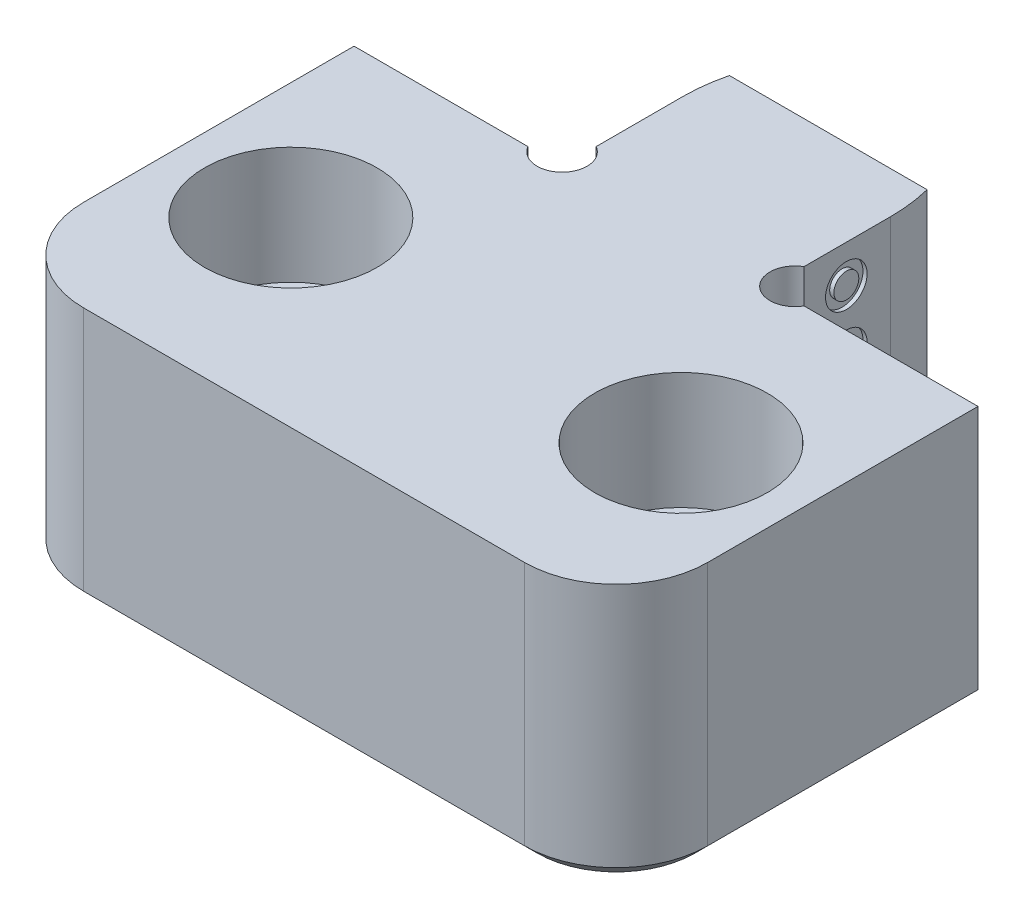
from build123d import *

# Parameters (mm, degrees)
BOSS_EXTRUDE1_DEPTH     = 15.748
SKETCH3_R               = 1.524
CUT_EXTRUDE2_DEPTH      = 34.154541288
CUT_EXTRUDE3_DEPTH      = 47.775325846
FILLET1_R               = 5.588
CHAMFER3_SIZE           = 0.762
F_1_4_CBORE_D           = 7.1374
F_1_4_CBORE_CBORE_D     = 10.541
F_1_4_CBORE_CBORE_DEPTH = 7.14502
SKETCH8_R               = 1.27
SKETCH8_R_2             = 0.762
CUT_EXTRUDE4_DEPTH      = 0.254


with BuildPart() as part:
    # Sketch1 → Boss-Extrude1 (new body)
    with BuildSketch(Plane(origin=(0, 0, 0), x_dir=(1, 0, 0), z_dir=(0, 1, 0))):
        with BuildLine():
            Line((-19.05, -22.098), (19.05, -22.098))
            Line((19.05, -22.098), (19.05, 0))
            Line((19.05, 0), (6.34746, 0))
            Line((6.34746, 0), (6.34746, 7.366))
            ThreePointArc((6.34746, 7.366), (6.269189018, 8.645540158), (6.035543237, 9.906))
            Line((6.035543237, 9.906), (-6.035543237, 9.906))
            ThreePointArc((-6.035543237, 9.906), (-6.269189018, 8.645540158), (-6.34746, 7.366))
            Line((-6.34746, 7.366), (-6.34746, 0))
            Line((-6.34746, 0), (-19.05, 0))
            Line((-19.05, 0), (-19.05, -22.098))
        make_face()
    extrude(amount=-BOSS_EXTRUDE1_DEPTH)

    # Sketch3 → Cut-Extrude2 (cut, through all)
    with BuildSketch(Plane(origin=(0, 0, 0), x_dir=(1, 0, 0), z_dir=(0, 1, 0))):
        with Locations((7.10946, 0.762)):
            Circle(SKETCH3_R)
        with Locations((-7.10946, 0.762)):
            Circle(SKETCH3_R)
    extrude(amount=-CUT_EXTRUDE2_DEPTH, mode=Mode.SUBTRACT)

    # Sketch5 → Cut-Extrude3 (cut, through all)
    with BuildSketch(Plane(origin=(19.05, 0, 0), x_dir=(0, 0, -1), z_dir=(1, 0, 0))):
        with BuildLine():
            Line((0, -15.494), (0, -31.065231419))
            Line((0, -31.065231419), (50.8, -31.065231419))
            Line((50.8, -31.065231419), (50.8, 7.034768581))
            ThreePointArc((50.8, 7.034768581), (29.03087619, -9.587069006), (2.286, -15.494))
            Line((2.286, -15.494), (0, -15.494))
        make_face()
    extrude(amount=-CUT_EXTRUDE3_DEPTH, mode=Mode.SUBTRACT)

    # Fillet1
    fillet1_edges = [part.edges().sort_by_distance(p)[0] for p in [
        (19.05, -7.874, 22.098),
        (-19.05, -7.874, 22.098),
    ]]
    fillet(fillet1_edges, radius=FILLET1_R)

    # Chamfer3
    chamfer3_edges = [part.edges().sort_by_distance(p)[0] for p in [
        (-19.05, -15.748, 8.255),
        (0, -15.748, 22.098),
        (19.05, -15.748, 8.255),
        (17.413312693, -15.748, 20.461312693),
        (-17.413312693, -15.748, 20.461312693),
    ]]
    chamfer(chamfer3_edges, length=CHAMFER3_SIZE)

    # 1_4_ CBORE (through all)
    with Locations(Plane(origin=(0, 0, 0), x_dir=(-1, 0, 0), z_dir=(0, 1, 0))):
        with Locations((11.9126, 10.9982), (-11.9126, 10.9982)):
            CounterBoreHole(F_1_4_CBORE_D / 2, F_1_4_CBORE_CBORE_D / 2, F_1_4_CBORE_CBORE_DEPTH)

    # Sketch8 → Cut-Extrude4 (cut)
    # profile 1 of 4: a face of its own
    with BuildSketch(Plane(origin=(6.34746, 0, 0), x_dir=(0, 0, -1), z_dir=(1, 0, 0))):
        with Locations((4.662022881, -2.292118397)):
            Circle(SKETCH8_R)
        with Locations((4.662022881, -2.292118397)):
            Circle(SKETCH8_R_2, mode=Mode.SUBTRACT)
    # profile 2 of 4: a face of its own
    with BuildSketch(Plane(origin=(6.34746, 0, 0), x_dir=(0, 0, -1), z_dir=(1, 0, 0))):
        with Locations((4.662022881, -5.915407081)):
            Circle(SKETCH8_R)
        with Locations((4.662022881, -5.915407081)):
            Circle(SKETCH8_R_2, mode=Mode.SUBTRACT)
    # profile 3 of 4: a face of its own
    with BuildSketch(Plane(origin=(6.34746, 0, 0), x_dir=(0, 0, -1), z_dir=(1, 0, 0))):
        with Locations((4.662022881, -12.725443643)):
            Circle(SKETCH8_R)
        with Locations((4.662022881, -12.725443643)):
            Circle(SKETCH8_R_2, mode=Mode.SUBTRACT)
    # profile 4 of 4: a face of its own
    with BuildSketch(Plane(origin=(6.34746, 0, 0), x_dir=(0, 0, -1), z_dir=(1, 0, 0))):
        with Locations((4.662022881, -9.495041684)):
            Circle(SKETCH8_R)
        with Locations((4.662022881, -9.495041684)):
            Circle(SKETCH8_R_2, mode=Mode.SUBTRACT)
    cut_extrude4 = extrude(amount=-CUT_EXTRUDE4_DEPTH, mode=Mode.SUBTRACT)

    # Mirror1: Cut-Extrude4 across plane
    add(cut_extrude4.mirror(Plane(origin=(0, 0, 0), x_dir=(0, 0, 1), z_dir=(1, 0, 0))), mode=Mode.SUBTRACT)


solid = part.part
